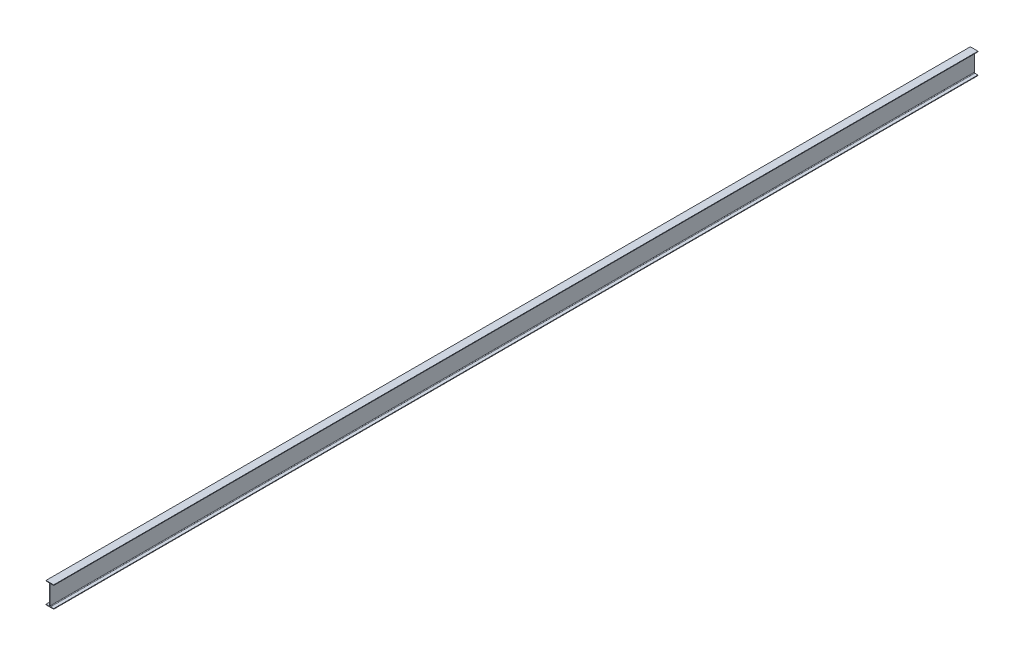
ISO-10303-21;
HEADER;
FILE_DESCRIPTION(('STEP AP214'),'2;1');
FILE_NAME('part.step','',(''),(''),'','','');
FILE_SCHEMA(('AUTOMOTIVE_DESIGN { 1 0 10303 214 1 1 1 1 }'));
ENDSEC;
DATA;
#1=APPLICATION_CONTEXT('core data for automotive mechanical design processes');
#2=APPLICATION_PROTOCOL_DEFINITION('international standard','automotive_design',2000,#1);
#3=PRODUCT_CONTEXT('',#1,'mechanical');
#4=PRODUCT('Part','Part','',(#3));
#5=PRODUCT_RELATED_PRODUCT_CATEGORY('part','',(#4));
#6=PRODUCT_DEFINITION_FORMATION('','',#4);
#7=PRODUCT_DEFINITION_CONTEXT('part definition',#1,'design');
#8=PRODUCT_DEFINITION('design','',#6,#7);
#9=PRODUCT_DEFINITION_SHAPE('','',#8);
#10=(LENGTH_UNIT() NAMED_UNIT(*) SI_UNIT(.MILLI.,.METRE.));
#11=(NAMED_UNIT(*) PLANE_ANGLE_UNIT() SI_UNIT($,.RADIAN.));
#12=(NAMED_UNIT(*) SI_UNIT($,.STERADIAN.) SOLID_ANGLE_UNIT());
#13=UNCERTAINTY_MEASURE_WITH_UNIT(LENGTH_MEASURE(1.E-05),#10,'distance_accuracy_value','');
#14=(GEOMETRIC_REPRESENTATION_CONTEXT(3) GLOBAL_UNCERTAINTY_ASSIGNED_CONTEXT((#13)) GLOBAL_UNIT_ASSIGNED_CONTEXT((#10,
#11,#12)) REPRESENTATION_CONTEXT('',''));
#15=CARTESIAN_POINT('',(0.,0.,0.));
#16=DIRECTION('',(0.,0.,1.));
#17=DIRECTION('',(1.,0.,0.));
#18=AXIS2_PLACEMENT_3D('',#15,#16,#17);
#19=CARTESIAN_POINT('',(63.4999999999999,-174.498,7632.7));
#20=DIRECTION('',(0.,1.,0.));
#21=DIRECTION('',(0.,0.,1.));
#22=AXIS2_PLACEMENT_3D('',#19,#20,#21);
#23=PLANE('',#22);
#24=DIRECTION('',(1.,0.,0.));
#25=VECTOR('',#24,1.);
#26=CARTESIAN_POINT('',(63.4999999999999,-174.498,-7632.7));
#27=LINE('',#26,#25);
#28=CARTESIAN_POINT('',(-63.4999999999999,-174.498,-7632.7));
#29=VERTEX_POINT('',#28);
#30=CARTESIAN_POINT('',(63.4999999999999,-174.498,-7632.7));
#31=VERTEX_POINT('',#30);
#32=EDGE_CURVE('E177',#29,#31,#27,.T.);
#33=ORIENTED_EDGE('',*,*,#32,.T.);
#34=DIRECTION('',(0.,0.,-1.));
#35=VECTOR('',#34,1.);
#36=CARTESIAN_POINT('',(63.4999999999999,-174.498,7632.7));
#37=LINE('',#36,#35);
#38=CARTESIAN_POINT('',(63.4999999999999,-174.498,7632.7));
#39=VERTEX_POINT('',#38);
#40=EDGE_CURVE('E11',#39,#31,#37,.T.);
#41=ORIENTED_EDGE('',*,*,#40,.F.);
#42=DIRECTION('',(1.,0.,0.));
#43=VECTOR('',#42,1.);
#44=CARTESIAN_POINT('',(63.4999999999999,-174.498,7632.7));
#45=LINE('',#44,#43);
#46=CARTESIAN_POINT('',(-63.4999999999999,-174.498,7632.7));
#47=VERTEX_POINT('',#46);
#48=EDGE_CURVE('E207',#47,#39,#45,.T.);
#49=ORIENTED_EDGE('',*,*,#48,.F.);
#50=DIRECTION('',(0.,0.,-1.));
#51=VECTOR('',#50,1.);
#52=CARTESIAN_POINT('',(-63.4999999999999,-174.498,7632.7));
#53=LINE('',#52,#51);
#54=EDGE_CURVE('E173',#47,#29,#53,.T.);
#55=ORIENTED_EDGE('',*,*,#54,.T.);
#56=EDGE_LOOP('',(#33,#41,#49,#55));
#57=FACE_BOUND('',#56,.T.);
#58=ADVANCED_FACE('F33',(#57),#23,.F.);
#59=CARTESIAN_POINT('',(63.4999999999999,-165.989,7632.7));
#60=DIRECTION('',(-1.,0.,0.));
#61=DIRECTION('',(0.,0.,1.));
#62=AXIS2_PLACEMENT_3D('',#59,#60,#61);
#63=PLANE('',#62);
#64=DIRECTION('',(0.,1.,0.));
#65=VECTOR('',#64,1.);
#66=CARTESIAN_POINT('',(63.4999999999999,-165.989,-7632.7));
#67=LINE('',#66,#65);
#68=CARTESIAN_POINT('',(63.4999999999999,-165.989,-7632.7));
#69=VERTEX_POINT('',#68);
#70=EDGE_CURVE('E180',#31,#69,#67,.T.);
#71=ORIENTED_EDGE('',*,*,#70,.T.);
#72=DIRECTION('',(0.,0.,-1.));
#73=VECTOR('',#72,1.);
#74=CARTESIAN_POINT('',(63.4999999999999,-165.989,7632.7));
#75=LINE('',#74,#73);
#76=CARTESIAN_POINT('',(63.4999999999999,-165.989,7632.7));
#77=VERTEX_POINT('',#76);
#78=EDGE_CURVE('E41',#77,#69,#75,.T.);
#79=ORIENTED_EDGE('',*,*,#78,.F.);
#80=DIRECTION('',(0.,1.,0.));
#81=VECTOR('',#80,1.);
#82=CARTESIAN_POINT('',(63.4999999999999,-165.989,7632.7));
#83=LINE('',#82,#81);
#84=EDGE_CURVE('E116',#39,#77,#83,.T.);
#85=ORIENTED_EDGE('',*,*,#84,.F.);
#86=ORIENTED_EDGE('',*,*,#40,.T.);
#87=EDGE_LOOP('',(#71,#79,#85,#86));
#88=FACE_BOUND('',#87,.T.);
#89=ADVANCED_FACE('F305',(#88),#63,.F.);
#90=CARTESIAN_POINT('',(13.081,-165.989,7632.7));
#91=DIRECTION('',(0.,-1.,0.));
#92=DIRECTION('',(1.,0.,0.));
#93=AXIS2_PLACEMENT_3D('',#90,#91,#92);
#94=PLANE('',#93);
#95=DIRECTION('',(-1.,0.,0.));
#96=VECTOR('',#95,1.);
#97=CARTESIAN_POINT('',(13.081,-165.989,-7632.7));
#98=LINE('',#97,#96);
#99=CARTESIAN_POINT('',(13.081,-165.989,-7632.7));
#100=VERTEX_POINT('',#99);
#101=EDGE_CURVE('E182',#69,#100,#98,.T.);
#102=ORIENTED_EDGE('',*,*,#101,.T.);
#103=DIRECTION('',(0.,0.,-1.));
#104=VECTOR('',#103,1.);
#105=CARTESIAN_POINT('',(13.081,-165.989,7632.7));
#106=LINE('',#105,#104);
#107=CARTESIAN_POINT('',(13.081,-165.989,7632.7));
#108=VERTEX_POINT('',#107);
#109=EDGE_CURVE('E238',#108,#100,#106,.T.);
#110=ORIENTED_EDGE('',*,*,#109,.F.);
#111=DIRECTION('',(-1.,0.,0.));
#112=VECTOR('',#111,1.);
#113=CARTESIAN_POINT('',(13.081,-165.989,7632.7));
#114=LINE('',#113,#112);
#115=EDGE_CURVE('E246',#77,#108,#114,.T.);
#116=ORIENTED_EDGE('',*,*,#115,.F.);
#117=ORIENTED_EDGE('',*,*,#78,.T.);
#118=EDGE_LOOP('',(#102,#110,#116,#117));
#119=FACE_BOUND('',#118,.T.);
#120=ADVANCED_FACE('F244',(#119),#94,.F.);
#121=CARTESIAN_POINT('',(13.081,-155.829,7632.7));
#122=DIRECTION('',(0.,0.,-1.));
#123=DIRECTION('',(-1.,0.,0.));
#124=AXIS2_PLACEMENT_3D('',#121,#122,#123);
#125=CYLINDRICAL_SURFACE('',#124,10.16);
#126=CARTESIAN_POINT('',(13.081,-155.829,-7632.7));
#127=DIRECTION('',(0.,0.,-1.));
#128=DIRECTION('',(1.,0.,0.));
#129=AXIS2_PLACEMENT_3D('',#126,#127,#128);
#130=CIRCLE('',#129,10.16);
#131=CARTESIAN_POINT('',(2.92100000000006,-155.829,-7632.7));
#132=VERTEX_POINT('',#131);
#133=EDGE_CURVE('E184',#100,#132,#130,.T.);
#134=ORIENTED_EDGE('',*,*,#133,.T.);
#135=DIRECTION('',(0.,0.,-1.));
#136=VECTOR('',#135,1.);
#137=CARTESIAN_POINT('',(2.92100000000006,-155.829,7632.7));
#138=LINE('',#137,#136);
#139=CARTESIAN_POINT('',(2.92100000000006,-155.829,7632.7));
#140=VERTEX_POINT('',#139);
#141=EDGE_CURVE('E235',#140,#132,#138,.T.);
#142=ORIENTED_EDGE('',*,*,#141,.F.);
#143=CARTESIAN_POINT('',(13.081,-155.829,7632.7));
#144=DIRECTION('',(0.,0.,-1.));
#145=DIRECTION('',(1.,0.,0.));
#146=AXIS2_PLACEMENT_3D('',#143,#144,#145);
#147=CIRCLE('',#146,10.16);
#148=EDGE_CURVE('E264',#108,#140,#147,.T.);
#149=ORIENTED_EDGE('',*,*,#148,.F.);
#150=ORIENTED_EDGE('',*,*,#109,.T.);
#151=EDGE_LOOP('',(#134,#142,#149,#150));
#152=FACE_BOUND('',#151,.T.);
#153=ADVANCED_FACE('F255',(#152),#125,.F.);
#154=CARTESIAN_POINT('',(2.92100000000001,155.829,7632.7));
#155=DIRECTION('',(-1.,0.,0.));
#156=DIRECTION('',(0.,-1.,0.));
#157=AXIS2_PLACEMENT_3D('',#154,#155,#156);
#158=PLANE('',#157);
#159=DIRECTION('',(0.,1.,0.));
#160=VECTOR('',#159,1.);
#161=CARTESIAN_POINT('',(2.92100000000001,155.829,-7632.7));
#162=LINE('',#161,#160);
#163=CARTESIAN_POINT('',(2.921,155.829,-7632.7));
#164=VERTEX_POINT('',#163);
#165=EDGE_CURVE('E186',#132,#164,#162,.T.);
#166=ORIENTED_EDGE('',*,*,#165,.T.);
#167=DIRECTION('',(0.,0.,-1.));
#168=VECTOR('',#167,1.);
#169=CARTESIAN_POINT('',(2.921,155.829,7632.7));
#170=LINE('',#169,#168);
#171=CARTESIAN_POINT('',(2.921,155.829,7632.7));
#172=VERTEX_POINT('',#171);
#173=EDGE_CURVE('E232',#172,#164,#170,.T.);
#174=ORIENTED_EDGE('',*,*,#173,.F.);
#175=DIRECTION('',(0.,1.,0.));
#176=VECTOR('',#175,1.);
#177=CARTESIAN_POINT('',(2.92100000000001,155.829,7632.7));
#178=LINE('',#177,#176);
#179=EDGE_CURVE('E261',#140,#172,#178,.T.);
#180=ORIENTED_EDGE('',*,*,#179,.F.);
#181=ORIENTED_EDGE('',*,*,#141,.T.);
#182=EDGE_LOOP('',(#166,#174,#180,#181));
#183=FACE_BOUND('',#182,.T.);
#184=ADVANCED_FACE('F259',(#183),#158,.F.);
#185=CARTESIAN_POINT('',(13.081,155.829,7632.7));
#186=DIRECTION('',(0.,0.,-1.));
#187=DIRECTION('',(-1.,0.,0.));
#188=AXIS2_PLACEMENT_3D('',#185,#186,#187);
#189=CYLINDRICAL_SURFACE('',#188,10.16);
#190=CARTESIAN_POINT('',(13.081,155.829,-7632.7));
#191=DIRECTION('',(0.,0.,-1.));
#192=DIRECTION('',(1.,0.,0.));
#193=AXIS2_PLACEMENT_3D('',#190,#191,#192);
#194=CIRCLE('',#193,10.16);
#195=CARTESIAN_POINT('',(13.081,165.989,-7632.7));
#196=VERTEX_POINT('',#195);
#197=EDGE_CURVE('E188',#164,#196,#194,.T.);
#198=ORIENTED_EDGE('',*,*,#197,.T.);
#199=DIRECTION('',(0.,0.,-1.));
#200=VECTOR('',#199,1.);
#201=CARTESIAN_POINT('',(13.081,165.989,7632.7));
#202=LINE('',#201,#200);
#203=CARTESIAN_POINT('',(13.081,165.989,7632.7));
#204=VERTEX_POINT('',#203);
#205=EDGE_CURVE('E229',#204,#196,#202,.T.);
#206=ORIENTED_EDGE('',*,*,#205,.F.);
#207=CARTESIAN_POINT('',(13.081,155.829,7632.7));
#208=DIRECTION('',(0.,0.,-1.));
#209=DIRECTION('',(1.,0.,0.));
#210=AXIS2_PLACEMENT_3D('',#207,#208,#209);
#211=CIRCLE('',#210,10.16);
#212=EDGE_CURVE('E263',#172,#204,#211,.T.);
#213=ORIENTED_EDGE('',*,*,#212,.F.);
#214=ORIENTED_EDGE('',*,*,#173,.T.);
#215=EDGE_LOOP('',(#198,#206,#213,#214));
#216=FACE_BOUND('',#215,.T.);
#217=ADVANCED_FACE('F318',(#216),#189,.F.);
#218=CARTESIAN_POINT('',(63.5,165.989,7632.7));
#219=DIRECTION('',(0.,1.,0.));
#220=DIRECTION('',(0.,0.,1.));
#221=AXIS2_PLACEMENT_3D('',#218,#219,#220);
#222=PLANE('',#221);
#223=DIRECTION('',(1.,0.,0.));
#224=VECTOR('',#223,1.);
#225=CARTESIAN_POINT('',(63.5,165.989,-7632.7));
#226=LINE('',#225,#224);
#227=CARTESIAN_POINT('',(63.5,165.989,-7632.7));
#228=VERTEX_POINT('',#227);
#229=EDGE_CURVE('E190',#196,#228,#226,.T.);
#230=ORIENTED_EDGE('',*,*,#229,.T.);
#231=DIRECTION('',(0.,0.,-1.));
#232=VECTOR('',#231,1.);
#233=CARTESIAN_POINT('',(63.5,165.989,7632.7));
#234=LINE('',#233,#232);
#235=CARTESIAN_POINT('',(63.5,165.989,7632.7));
#236=VERTEX_POINT('',#235);
#237=EDGE_CURVE('E226',#236,#228,#234,.T.);
#238=ORIENTED_EDGE('',*,*,#237,.F.);
#239=DIRECTION('',(1.,0.,0.));
#240=VECTOR('',#239,1.);
#241=CARTESIAN_POINT('',(63.5,165.989,7632.7));
#242=LINE('',#241,#240);
#243=EDGE_CURVE('E266',#204,#236,#242,.T.);
#244=ORIENTED_EDGE('',*,*,#243,.F.);
#245=ORIENTED_EDGE('',*,*,#205,.T.);
#246=EDGE_LOOP('',(#230,#238,#244,#245));
#247=FACE_BOUND('',#246,.T.);
#248=ADVANCED_FACE('F321',(#247),#222,.F.);
#249=CARTESIAN_POINT('',(63.5,174.498,7632.7));
#250=DIRECTION('',(-1.,0.,0.));
#251=DIRECTION('',(0.,0.,1.));
#252=AXIS2_PLACEMENT_3D('',#249,#250,#251);
#253=PLANE('',#252);
#254=DIRECTION('',(0.,1.,0.));
#255=VECTOR('',#254,1.);
#256=CARTESIAN_POINT('',(63.5,174.498,-7632.7));
#257=LINE('',#256,#255);
#258=CARTESIAN_POINT('',(63.5,174.498,-7632.7));
#259=VERTEX_POINT('',#258);
#260=EDGE_CURVE('E192',#228,#259,#257,.T.);
#261=ORIENTED_EDGE('',*,*,#260,.T.);
#262=DIRECTION('',(0.,0.,-1.));
#263=VECTOR('',#262,1.);
#264=CARTESIAN_POINT('',(63.5,174.498,7632.7));
#265=LINE('',#264,#263);
#266=CARTESIAN_POINT('',(63.5,174.498,7632.7));
#267=VERTEX_POINT('',#266);
#268=EDGE_CURVE('E223',#267,#259,#265,.T.);
#269=ORIENTED_EDGE('',*,*,#268,.F.);
#270=DIRECTION('',(0.,1.,0.));
#271=VECTOR('',#270,1.);
#272=CARTESIAN_POINT('',(63.5,174.498,7632.7));
#273=LINE('',#272,#271);
#274=EDGE_CURVE('E272',#236,#267,#273,.T.);
#275=ORIENTED_EDGE('',*,*,#274,.F.);
#276=ORIENTED_EDGE('',*,*,#237,.T.);
#277=EDGE_LOOP('',(#261,#269,#275,#276));
#278=FACE_BOUND('',#277,.T.);
#279=ADVANCED_FACE('F325',(#278),#253,.F.);
#280=CARTESIAN_POINT('',(-63.5,174.498,7632.7));
#281=DIRECTION('',(0.,-1.,0.));
#282=DIRECTION('',(0.,0.,-1.));
#283=AXIS2_PLACEMENT_3D('',#280,#281,#282);
#284=PLANE('',#283);
#285=DIRECTION('',(-1.,0.,0.));
#286=VECTOR('',#285,1.);
#287=CARTESIAN_POINT('',(-63.5,174.498,-7632.7));
#288=LINE('',#287,#286);
#289=CARTESIAN_POINT('',(-63.5,174.498,-7632.7));
#290=VERTEX_POINT('',#289);
#291=EDGE_CURVE('E194',#259,#290,#288,.T.);
#292=ORIENTED_EDGE('',*,*,#291,.T.);
#293=DIRECTION('',(0.,0.,-1.));
#294=VECTOR('',#293,1.);
#295=CARTESIAN_POINT('',(-63.5,174.498,7632.7));
#296=LINE('',#295,#294);
#297=CARTESIAN_POINT('',(-63.5,174.498,7632.7));
#298=VERTEX_POINT('',#297);
#299=EDGE_CURVE('E220',#298,#290,#296,.T.);
#300=ORIENTED_EDGE('',*,*,#299,.F.);
#301=DIRECTION('',(-1.,0.,0.));
#302=VECTOR('',#301,1.);
#303=CARTESIAN_POINT('',(-63.5,174.498,7632.7));
#304=LINE('',#303,#302);
#305=EDGE_CURVE('E274',#267,#298,#304,.T.);
#306=ORIENTED_EDGE('',*,*,#305,.F.);
#307=ORIENTED_EDGE('',*,*,#268,.T.);
#308=EDGE_LOOP('',(#292,#300,#306,#307));
#309=FACE_BOUND('',#308,.T.);
#310=ADVANCED_FACE('F329',(#309),#284,.F.);
#311=CARTESIAN_POINT('',(-63.5,165.989,7632.7));
#312=DIRECTION('',(1.,0.,0.));
#313=DIRECTION('',(0.,0.,-1.));
#314=AXIS2_PLACEMENT_3D('',#311,#312,#313);
#315=PLANE('',#314);
#316=DIRECTION('',(0.,-1.,0.));
#317=VECTOR('',#316,1.);
#318=CARTESIAN_POINT('',(-63.5,165.989,-7632.7));
#319=LINE('',#318,#317);
#320=CARTESIAN_POINT('',(-63.5,165.989,-7632.7));
#321=VERTEX_POINT('',#320);
#322=EDGE_CURVE('E196',#290,#321,#319,.T.);
#323=ORIENTED_EDGE('',*,*,#322,.T.);
#324=DIRECTION('',(0.,0.,-1.));
#325=VECTOR('',#324,1.);
#326=CARTESIAN_POINT('',(-63.5,165.989,7632.7));
#327=LINE('',#326,#325);
#328=CARTESIAN_POINT('',(-63.5,165.989,7632.7));
#329=VERTEX_POINT('',#328);
#330=EDGE_CURVE('E217',#329,#321,#327,.T.);
#331=ORIENTED_EDGE('',*,*,#330,.F.);
#332=DIRECTION('',(0.,-1.,0.));
#333=VECTOR('',#332,1.);
#334=CARTESIAN_POINT('',(-63.5,165.989,7632.7));
#335=LINE('',#334,#333);
#336=EDGE_CURVE('E276',#298,#329,#335,.T.);
#337=ORIENTED_EDGE('',*,*,#336,.F.);
#338=ORIENTED_EDGE('',*,*,#299,.T.);
#339=EDGE_LOOP('',(#323,#331,#337,#338));
#340=FACE_BOUND('',#339,.T.);
#341=ADVANCED_FACE('F333',(#340),#315,.F.);
#342=CARTESIAN_POINT('',(-13.081,165.989,7632.7));
#343=DIRECTION('',(0.,1.,0.));
#344=DIRECTION('',(0.,0.,1.));
#345=AXIS2_PLACEMENT_3D('',#342,#343,#344);
#346=PLANE('',#345);
#347=DIRECTION('',(1.,0.,0.));
#348=VECTOR('',#347,1.);
#349=CARTESIAN_POINT('',(-13.081,165.989,-7632.7));
#350=LINE('',#349,#348);
#351=CARTESIAN_POINT('',(-13.081,165.989,-7632.7));
#352=VERTEX_POINT('',#351);
#353=EDGE_CURVE('E198',#321,#352,#350,.T.);
#354=ORIENTED_EDGE('',*,*,#353,.T.);
#355=DIRECTION('',(0.,0.,-1.));
#356=VECTOR('',#355,1.);
#357=CARTESIAN_POINT('',(-13.081,165.989,7632.7));
#358=LINE('',#357,#356);
#359=CARTESIAN_POINT('',(-13.081,165.989,7632.7));
#360=VERTEX_POINT('',#359);
#361=EDGE_CURVE('E214',#360,#352,#358,.T.);
#362=ORIENTED_EDGE('',*,*,#361,.F.);
#363=DIRECTION('',(1.,0.,0.));
#364=VECTOR('',#363,1.);
#365=CARTESIAN_POINT('',(-13.081,165.989,7632.7));
#366=LINE('',#365,#364);
#367=EDGE_CURVE('E278',#329,#360,#366,.T.);
#368=ORIENTED_EDGE('',*,*,#367,.F.);
#369=ORIENTED_EDGE('',*,*,#330,.T.);
#370=EDGE_LOOP('',(#354,#362,#368,#369));
#371=FACE_BOUND('',#370,.T.);
#372=ADVANCED_FACE('F337',(#371),#346,.F.);
#373=CARTESIAN_POINT('',(-13.081,155.829,7632.7));
#374=DIRECTION('',(0.,0.,-1.));
#375=DIRECTION('',(-1.,0.,0.));
#376=AXIS2_PLACEMENT_3D('',#373,#374,#375);
#377=CYLINDRICAL_SURFACE('',#376,10.16);
#378=CARTESIAN_POINT('',(-13.081,155.829,-7632.7));
#379=DIRECTION('',(0.,0.,-1.));
#380=DIRECTION('',(1.,0.,0.));
#381=AXIS2_PLACEMENT_3D('',#378,#379,#380);
#382=CIRCLE('',#381,10.16);
#383=CARTESIAN_POINT('',(-2.92100000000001,155.829,-7632.7));
#384=VERTEX_POINT('',#383);
#385=EDGE_CURVE('E200',#352,#384,#382,.T.);
#386=ORIENTED_EDGE('',*,*,#385,.T.);
#387=DIRECTION('',(0.,0.,-1.));
#388=VECTOR('',#387,1.);
#389=CARTESIAN_POINT('',(-2.92100000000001,155.829,7632.7));
#390=LINE('',#389,#388);
#391=CARTESIAN_POINT('',(-2.92100000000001,155.829,7632.7));
#392=VERTEX_POINT('',#391);
#393=EDGE_CURVE('E211',#392,#384,#390,.T.);
#394=ORIENTED_EDGE('',*,*,#393,.F.);
#395=CARTESIAN_POINT('',(-13.081,155.829,7632.7));
#396=DIRECTION('',(0.,0.,-1.));
#397=DIRECTION('',(1.,0.,0.));
#398=AXIS2_PLACEMENT_3D('',#395,#396,#397);
#399=CIRCLE('',#398,10.16);
#400=EDGE_CURVE('E280',#360,#392,#399,.T.);
#401=ORIENTED_EDGE('',*,*,#400,.F.);
#402=ORIENTED_EDGE('',*,*,#361,.T.);
#403=EDGE_LOOP('',(#386,#394,#401,#402));
#404=FACE_BOUND('',#403,.T.);
#405=ADVANCED_FACE('F286',(#404),#377,.F.);
#406=CARTESIAN_POINT('',(-2.92099999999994,-155.829,7632.7));
#407=DIRECTION('',(1.,0.,0.));
#408=DIRECTION('',(0.,1.,0.));
#409=AXIS2_PLACEMENT_3D('',#406,#407,#408);
#410=PLANE('',#409);
#411=DIRECTION('',(0.,-1.,0.));
#412=VECTOR('',#411,1.);
#413=CARTESIAN_POINT('',(-2.92099999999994,-155.829,-7632.7));
#414=LINE('',#413,#412);
#415=CARTESIAN_POINT('',(-2.92099999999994,-155.829,-7632.7));
#416=VERTEX_POINT('',#415);
#417=EDGE_CURVE('E202',#384,#416,#414,.T.);
#418=ORIENTED_EDGE('',*,*,#417,.T.);
#419=DIRECTION('',(0.,0.,-1.));
#420=VECTOR('',#419,1.);
#421=CARTESIAN_POINT('',(-2.92099999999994,-155.829,7632.7));
#422=LINE('',#421,#420);
#423=CARTESIAN_POINT('',(-2.92099999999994,-155.829,7632.7));
#424=VERTEX_POINT('',#423);
#425=EDGE_CURVE('E168',#424,#416,#422,.T.);
#426=ORIENTED_EDGE('',*,*,#425,.F.);
#427=DIRECTION('',(0.,-1.,0.));
#428=VECTOR('',#427,1.);
#429=CARTESIAN_POINT('',(-2.92099999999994,-155.829,7632.7));
#430=LINE('',#429,#428);
#431=EDGE_CURVE('E159',#392,#424,#430,.T.);
#432=ORIENTED_EDGE('',*,*,#431,.F.);
#433=ORIENTED_EDGE('',*,*,#393,.T.);
#434=EDGE_LOOP('',(#418,#426,#432,#433));
#435=FACE_BOUND('',#434,.T.);
#436=ADVANCED_FACE('F290',(#435),#410,.F.);
#437=CARTESIAN_POINT('',(-13.0809999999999,-155.829,7632.7));
#438=DIRECTION('',(0.,0.,-1.));
#439=DIRECTION('',(-1.,0.,0.));
#440=AXIS2_PLACEMENT_3D('',#437,#438,#439);
#441=CYLINDRICAL_SURFACE('',#440,10.16);
#442=CARTESIAN_POINT('',(-13.0809999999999,-155.829,-7632.7));
#443=DIRECTION('',(0.,0.,-1.));
#444=DIRECTION('',(1.,0.,0.));
#445=AXIS2_PLACEMENT_3D('',#442,#443,#444);
#446=CIRCLE('',#445,10.16);
#447=CARTESIAN_POINT('',(-13.0809999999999,-165.989,-7632.7));
#448=VERTEX_POINT('',#447);
#449=EDGE_CURVE('E167',#416,#448,#446,.T.);
#450=ORIENTED_EDGE('',*,*,#449,.T.);
#451=DIRECTION('',(0.,0.,-1.));
#452=VECTOR('',#451,1.);
#453=CARTESIAN_POINT('',(-13.0809999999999,-165.989,7632.7));
#454=LINE('',#453,#452);
#455=CARTESIAN_POINT('',(-13.0809999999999,-165.989,7632.7));
#456=VERTEX_POINT('',#455);
#457=EDGE_CURVE('E164',#456,#448,#454,.T.);
#458=ORIENTED_EDGE('',*,*,#457,.F.);
#459=CARTESIAN_POINT('',(-13.0809999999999,-155.829,7632.7));
#460=DIRECTION('',(0.,0.,-1.));
#461=DIRECTION('',(1.,0.,0.));
#462=AXIS2_PLACEMENT_3D('',#459,#460,#461);
#463=CIRCLE('',#462,10.16);
#464=EDGE_CURVE('E153',#424,#456,#463,.T.);
#465=ORIENTED_EDGE('',*,*,#464,.F.);
#466=ORIENTED_EDGE('',*,*,#425,.T.);
#467=EDGE_LOOP('',(#450,#458,#465,#466));
#468=FACE_BOUND('',#467,.T.);
#469=ADVANCED_FACE('F165',(#468),#441,.F.);
#470=CARTESIAN_POINT('',(-63.4999999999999,-165.989,7632.7));
#471=DIRECTION('',(0.,-1.,0.));
#472=DIRECTION('',(0.,0.,-1.));
#473=AXIS2_PLACEMENT_3D('',#470,#471,#472);
#474=PLANE('',#473);
#475=DIRECTION('',(-1.,0.,0.));
#476=VECTOR('',#475,1.);
#477=CARTESIAN_POINT('',(-63.4999999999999,-165.989,-7632.7));
#478=LINE('',#477,#476);
#479=CARTESIAN_POINT('',(-63.4999999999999,-165.989,-7632.7));
#480=VERTEX_POINT('',#479);
#481=EDGE_CURVE('E102',#448,#480,#478,.T.);
#482=ORIENTED_EDGE('',*,*,#481,.T.);
#483=DIRECTION('',(0.,0.,-1.));
#484=VECTOR('',#483,1.);
#485=CARTESIAN_POINT('',(-63.4999999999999,-165.989,7632.7));
#486=LINE('',#485,#484);
#487=CARTESIAN_POINT('',(-63.4999999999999,-165.989,7632.7));
#488=VERTEX_POINT('',#487);
#489=EDGE_CURVE('E169',#488,#480,#486,.T.);
#490=ORIENTED_EDGE('',*,*,#489,.F.);
#491=DIRECTION('',(-1.,0.,0.));
#492=VECTOR('',#491,1.);
#493=CARTESIAN_POINT('',(-63.4999999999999,-165.989,7632.7));
#494=LINE('',#493,#492);
#495=EDGE_CURVE('E157',#456,#488,#494,.T.);
#496=ORIENTED_EDGE('',*,*,#495,.F.);
#497=ORIENTED_EDGE('',*,*,#457,.T.);
#498=EDGE_LOOP('',(#482,#490,#496,#497));
#499=FACE_BOUND('',#498,.T.);
#500=ADVANCED_FACE('F171',(#499),#474,.F.);
#501=CARTESIAN_POINT('',(-63.4999999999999,-174.498,7632.7));
#502=DIRECTION('',(1.,0.,0.));
#503=DIRECTION('',(0.,0.,-1.));
#504=AXIS2_PLACEMENT_3D('',#501,#502,#503);
#505=PLANE('',#504);
#506=DIRECTION('',(0.,-1.,0.));
#507=VECTOR('',#506,1.);
#508=CARTESIAN_POINT('',(-63.4999999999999,-174.498,-7632.7));
#509=LINE('',#508,#507);
#510=EDGE_CURVE('E108',#480,#29,#509,.T.);
#511=ORIENTED_EDGE('',*,*,#510,.T.);
#512=ORIENTED_EDGE('',*,*,#54,.F.);
#513=DIRECTION('',(0.,-1.,0.));
#514=VECTOR('',#513,1.);
#515=CARTESIAN_POINT('',(-63.4999999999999,-174.498,7632.7));
#516=LINE('',#515,#514);
#517=EDGE_CURVE('E49',#488,#47,#516,.T.);
#518=ORIENTED_EDGE('',*,*,#517,.F.);
#519=ORIENTED_EDGE('',*,*,#489,.T.);
#520=EDGE_LOOP('',(#511,#512,#518,#519));
#521=FACE_BOUND('',#520,.T.);
#522=ADVANCED_FACE('F294',(#521),#505,.F.);
#523=CARTESIAN_POINT('',(-13.0809999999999,-155.829,7632.7));
#524=DIRECTION('',(0.,0.,1.));
#525=DIRECTION('',(1.,0.,0.));
#526=AXIS2_PLACEMENT_3D('',#523,#524,#525);
#527=PLANE('',#526);
#528=ORIENTED_EDGE('',*,*,#48,.T.);
#529=ORIENTED_EDGE('',*,*,#84,.T.);
#530=ORIENTED_EDGE('',*,*,#115,.T.);
#531=ORIENTED_EDGE('',*,*,#148,.T.);
#532=ORIENTED_EDGE('',*,*,#179,.T.);
#533=ORIENTED_EDGE('',*,*,#212,.T.);
#534=ORIENTED_EDGE('',*,*,#243,.T.);
#535=ORIENTED_EDGE('',*,*,#274,.T.);
#536=ORIENTED_EDGE('',*,*,#305,.T.);
#537=ORIENTED_EDGE('',*,*,#336,.T.);
#538=ORIENTED_EDGE('',*,*,#367,.T.);
#539=ORIENTED_EDGE('',*,*,#400,.T.);
#540=ORIENTED_EDGE('',*,*,#431,.T.);
#541=ORIENTED_EDGE('',*,*,#464,.T.);
#542=ORIENTED_EDGE('',*,*,#495,.T.);
#543=ORIENTED_EDGE('',*,*,#517,.T.);
#544=EDGE_LOOP('',(#528,#529,#530,#531,#532,#533,#534,#535,#536,#537,#538,#539,#540,#541,#542,#543));
#545=FACE_BOUND('',#544,.T.);
#546=ADVANCED_FACE('F155',(#545),#527,.T.);
#547=CARTESIAN_POINT('',(-13.0809999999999,-155.829,-7632.7));
#548=DIRECTION('',(0.,0.,1.));
#549=DIRECTION('',(1.,0.,0.));
#550=AXIS2_PLACEMENT_3D('',#547,#548,#549);
#551=PLANE('',#550);
#552=ORIENTED_EDGE('',*,*,#32,.F.);
#553=ORIENTED_EDGE('',*,*,#510,.F.);
#554=ORIENTED_EDGE('',*,*,#481,.F.);
#555=ORIENTED_EDGE('',*,*,#449,.F.);
#556=ORIENTED_EDGE('',*,*,#417,.F.);
#557=ORIENTED_EDGE('',*,*,#385,.F.);
#558=ORIENTED_EDGE('',*,*,#353,.F.);
#559=ORIENTED_EDGE('',*,*,#322,.F.);
#560=ORIENTED_EDGE('',*,*,#291,.F.);
#561=ORIENTED_EDGE('',*,*,#260,.F.);
#562=ORIENTED_EDGE('',*,*,#229,.F.);
#563=ORIENTED_EDGE('',*,*,#197,.F.);
#564=ORIENTED_EDGE('',*,*,#165,.F.);
#565=ORIENTED_EDGE('',*,*,#133,.F.);
#566=ORIENTED_EDGE('',*,*,#101,.F.);
#567=ORIENTED_EDGE('',*,*,#70,.F.);
#568=EDGE_LOOP('',(#552,#553,#554,#555,#556,#557,#558,#559,#560,#561,#562,#563,#564,#565,#566,#567));
#569=FACE_BOUND('',#568,.T.);
#570=ADVANCED_FACE('F250',(#569),#551,.F.);
#571=CLOSED_SHELL('',(#58,#89,#120,#153,#184,#217,#248,#279,#310,#341,#372,#405,#436,#469,#500,
#522,#546,#570));
#572=MANIFOLD_SOLID_BREP('B2',#571);
#573=ADVANCED_BREP_SHAPE_REPRESENTATION('',(#18,#572),#14);
#574=SHAPE_DEFINITION_REPRESENTATION(#9,#573);
ENDSEC;
END-ISO-10303-21;
